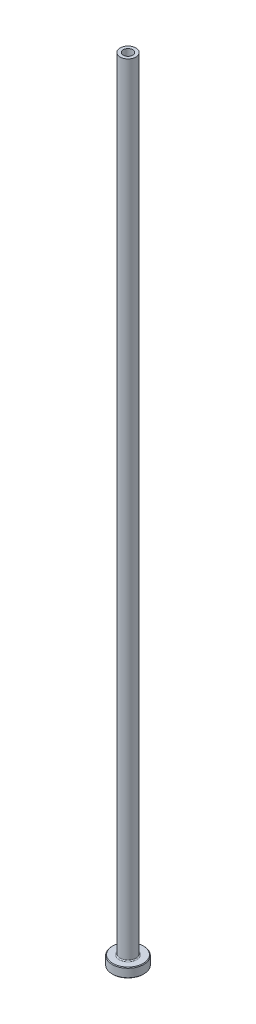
from build123d import *

# Parameters (mm, degrees)
FILLET1_R     = 0.3
CHAMFER1_SIZE = 0.2
CHAMFER3_SIZE = 0.5


with BuildPart() as part:
    # Sketch1 → Revolve1 (revolve)
    with BuildSketch(Plane.XY, mode=Mode.PRIVATE) as revolve1_sk:
        Polygon((-1.5, 250), (-2.5, 250), (-2.5, 3), (-5, 3), (-5, 0), (-1.75, 0), (-1.75, 193), (-1.5, 205), align=None)
    revolve(revolve1_sk.sketch.rotate(Axis((0, 92.187680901, 0), (0, -1, 0)), 270), axis=Axis((0, 92.187680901, 0), (0, -1, 0)))

    # Fillet1
    fillet1_edges = [part.edges().sort_by_distance(p)[0] for p in [
        (0, 3, -2.5),
    ]]
    fillet(fillet1_edges, radius=FILLET1_R)

    # Chamfer1
    chamfer1_edges = [part.edges().sort_by_distance(p)[0] for p in [
        (0, 0, -5),
        (0, 3, -5),
    ]]
    chamfer(chamfer1_edges, length=CHAMFER1_SIZE)

    # Chamfer3
    chamfer3_edges = [part.edges().sort_by_distance(p)[0] for p in [
        (0, 0, -1.75),
    ]]
    chamfer(chamfer3_edges, length=CHAMFER3_SIZE)


solid = part.part
